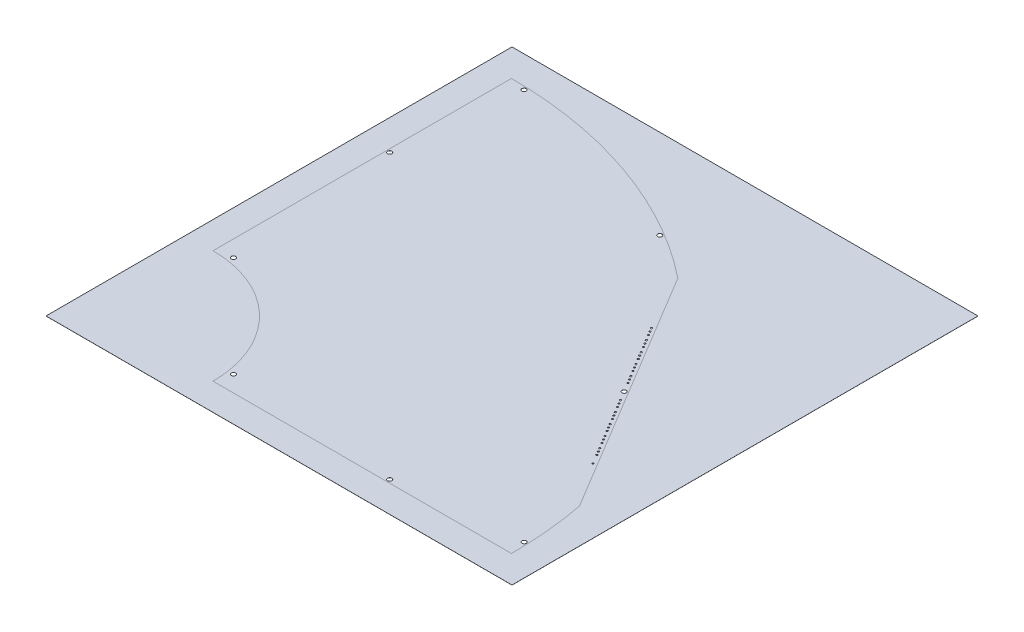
from build123d import *

# Parameters (mm, degrees)
SKETCH1_R      = 2
EXTRUDE1_DEPTH = 0.06
SKETCH2_R      = 0.75
EXTRUDE2_DEPTH = 539.814906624
SKETCH3_W      = 431
SKETCH3_H      = 431
EXTRUDE5_DEPTH = 0.06


with BuildPart() as part:
    # Sketch1 → Extrude1 (new body)
    with BuildSketch(Plane(origin=(0, 0, 0), x_dir=(1, 0, 0), z_dir=(0, 1, 0))):
        with BuildLine():
            Line((374.553309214, 69.791249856), (237.464143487, 297.945935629))
            ThreePointArc((237.464143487, 297.945935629), (126.020689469, 359.554983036), (0.5, 380.999671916))
            Line((0.5, 380.999671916), (0.5, 104.998809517))
            ThreePointArc((0.5, 104.998809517), (74.246212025, 74.246212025), (104.998809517, 0.5))
            Line((104.998809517, 0.5), (380.999671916, 0.5))
            ThreePointArc((380.999671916, 0.5), (379.361827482, 35.293113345), (374.553309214, 69.791249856))
        make_face()
        with Locations(Location((15.5, 377.682075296, 0), (0, 0, 270))):
            Circle(SKETCH1_R, mode=Mode.SUBTRACT)
        with Locations(Location((194.684392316, 324.009239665, 0), (0, 0, 270))):
            Circle(SKETCH1_R, mode=Mode.SUBTRACT)
        with Locations(Location((15.5, 108.902479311, 0), (0, 0, 270))):
            Circle(SKETCH1_R, mode=Mode.SUBTRACT)
        with Locations(Location((303.437224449, 182.323478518, 0), (0, 0, 270))):
            Circle(SKETCH1_R, mode=Mode.SUBTRACT)
        with Locations(Location((108.902479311, 15.5, 0), (0, 0, 270))):
            Circle(SKETCH1_R, mode=Mode.SUBTRACT)
        with Locations(Location((377.682075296, 15.5, 0), (0, 0, 270))):
            Circle(SKETCH1_R, mode=Mode.SUBTRACT)
        with Locations(Location((265.406923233, 3.5, 0), (0, 0, 270))):
            Circle(SKETCH1_R, mode=Mode.SUBTRACT)
        with Locations(Location((3.5, 265.406923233, 0), (0, 0, 270))):
            Circle(SKETCH1_R, mode=Mode.SUBTRACT)
    extrude(amount=EXTRUDE1_DEPTH)

    # Sketch2 → Extrude2 (cut, through all)
    with BuildSketch(Plane.XZ):
        with Locations(Location((298.286843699, -190.895151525, 0), (0, 0, 270))):
            Circle(SKETCH2_R)
        with Locations(Location((291.076310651, -202.895493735, 0), (0, 0, 270))):
            Circle(SKETCH2_R)
        with Locations(Location((289.016158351, -206.324162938, 0), (0, 0, 270))):
            Circle(SKETCH2_R)
        with Locations(Location((296.2266914, -194.323820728, 0), (0, 0, 270))):
            Circle(SKETCH2_R)
        with Locations(Location((294.1665391, -197.752489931, 0), (0, 0, 270))):
            Circle(SKETCH2_R)
        with Locations(Location((286.956006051, -209.752832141, 0), (0, 0, 270))):
            Circle(SKETCH2_R)
        with Locations(Location((283.865777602, -214.895835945, 0), (0, 0, 270))):
            Circle(SKETCH2_R)
        with Locations(Location((281.805625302, -218.324505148, 0), (0, 0, 270))):
            Circle(SKETCH2_R)
        with Locations(Location((279.745473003, -221.75317435, 0), (0, 0, 270))):
            Circle(SKETCH2_R)
        with Locations(Location((276.655244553, -226.896178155, 0), (0, 0, 270))):
            Circle(SKETCH2_R)
        with Locations(Location((274.595092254, -230.324847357, 0), (0, 0, 270))):
            Circle(SKETCH2_R)
        with Locations(Location((272.534939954, -233.75351656, 0), (0, 0, 270))):
            Circle(SKETCH2_R)
        with Locations(Location((269.444711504, -238.896520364, 0), (0, 0, 270))):
            Circle(SKETCH2_R)
        with Locations(Location((267.384559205, -242.325189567, 0), (0, 0, 270))):
            Circle(SKETCH2_R)
        with Locations(Location((265.324406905, -245.75385877, 0), (0, 0, 270))):
            Circle(SKETCH2_R)
        with Locations(Location((341.550041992, -118.893098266, 0), (0, 0, 90))):
            Circle(SKETCH2_R)
        with Locations(Location((339.489889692, -122.321767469, 0), (0, 0, 90))):
            Circle(SKETCH2_R)
        with Locations(Location((337.429737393, -125.750436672, 0), (0, 0, 90))):
            Circle(SKETCH2_R)
        with Locations(Location((334.339508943, -130.893440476, 0), (0, 0, 90))):
            Circle(SKETCH2_R)
        with Locations(Location((332.279356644, -134.322109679, 0), (0, 0, 90))):
            Circle(SKETCH2_R)
        with Locations(Location((330.219204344, -137.750778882, 0), (0, 0, 90))):
            Circle(SKETCH2_R)
        with Locations(Location((327.128975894, -142.893782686, 0), (0, 0, 90))):
            Circle(SKETCH2_R)
        with Locations(Location((325.068823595, -146.322451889, 0), (0, 0, 90))):
            Circle(SKETCH2_R)
        with Locations(Location((323.008671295, -149.751121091, 0), (0, 0, 90))):
            Circle(SKETCH2_R)
        with Locations(Location((319.918442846, -154.894124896, 0), (0, 0, 90))):
            Circle(SKETCH2_R)
        with Locations(Location((312.707909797, -166.894467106, 0), (0, 0, 90))):
            Circle(SKETCH2_R)
        with Locations(Location((310.647757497, -170.323136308, 0), (0, 0, 90))):
            Circle(SKETCH2_R)
        with Locations(Location((317.858290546, -158.322794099, 0), (0, 0, 90))):
            Circle(SKETCH2_R)
        with Locations(Location((315.798138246, -161.751463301, 0), (0, 0, 90))):
            Circle(SKETCH2_R)
        with Locations(Location((308.587605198, -173.751805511, 0), (0, 0, 90))):
            Circle(SKETCH2_R)
        with Locations(Location((346.700422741, -110.321425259, 0), (0, 0, 270))):
            Circle(SKETCH2_R)
    extrude(amount=-EXTRUDE2_DEPTH, mode=Mode.SUBTRACT)


with BuildPart() as body_2:
    # Sketch3 → Extrude5 (new body)
    with BuildSketch(Plane(origin=(0, 0, 0), x_dir=(1, 0, 0), z_dir=(0, 1, 0))):
        with Locations((191, 191)):
            Rectangle(SKETCH3_W, SKETCH3_H)
        with BuildLine():
            Line((104.998809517, 0.5), (380.999671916, 0.5))
            ThreePointArc((380.999671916, 0.5), (379.361827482, 35.293113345), (374.553309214, 69.791249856))
            Line((374.553309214, 69.791249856), (237.464143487, 297.945935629))
            ThreePointArc((237.464143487, 297.945935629), (126.020689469, 359.554983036), (0.5, 380.999671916))
            Line((0.5, 380.999671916), (0.5, 104.998809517))
            ThreePointArc((0.5, 104.998809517), (74.246212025, 74.246212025), (104.998809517, 0.5))
        make_face(mode=Mode.SUBTRACT)
    extrude(amount=EXTRUDE5_DEPTH)


solid = Compound([part.part, body_2.part])
